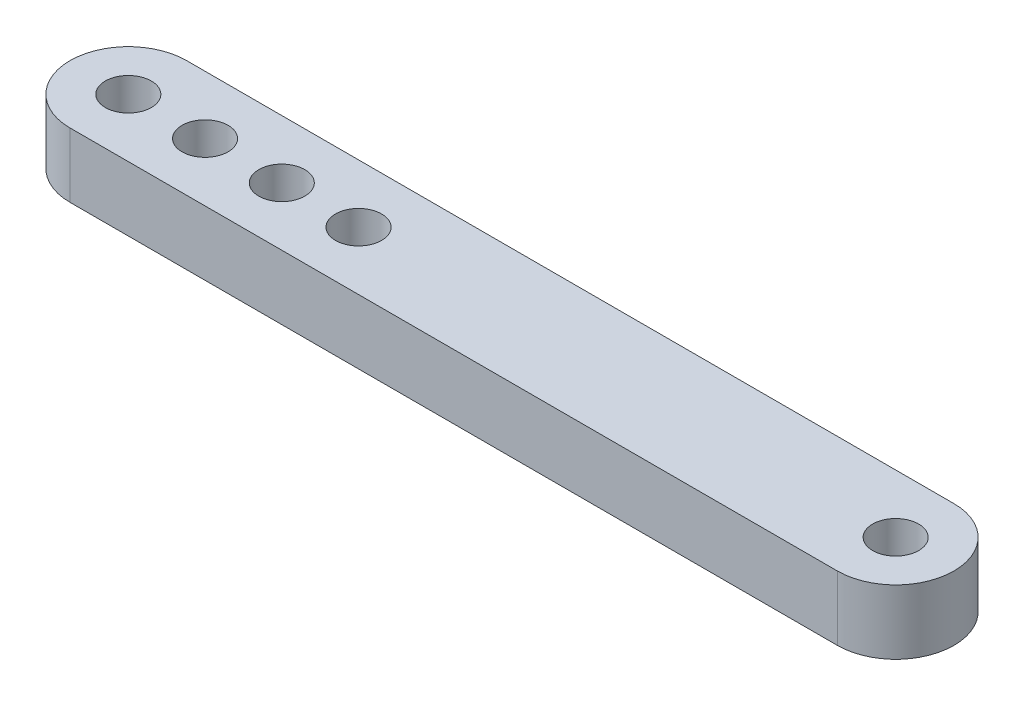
ISO-10303-21;
HEADER;
FILE_DESCRIPTION(('STEP AP214'),'2;1');
FILE_NAME('part.step','',(''),(''),'','','');
FILE_SCHEMA(('AUTOMOTIVE_DESIGN { 1 0 10303 214 1 1 1 1 }'));
ENDSEC;
DATA;
#1=APPLICATION_CONTEXT('core data for automotive mechanical design processes');
#2=APPLICATION_PROTOCOL_DEFINITION('international standard','automotive_design',2000,#1);
#3=PRODUCT_CONTEXT('',#1,'mechanical');
#4=PRODUCT('Part','Part','',(#3));
#5=PRODUCT_RELATED_PRODUCT_CATEGORY('part','',(#4));
#6=PRODUCT_DEFINITION_FORMATION('','',#4);
#7=PRODUCT_DEFINITION_CONTEXT('part definition',#1,'design');
#8=PRODUCT_DEFINITION('design','',#6,#7);
#9=PRODUCT_DEFINITION_SHAPE('','',#8);
#10=(LENGTH_UNIT() NAMED_UNIT(*) SI_UNIT(.MILLI.,.METRE.));
#11=(NAMED_UNIT(*) PLANE_ANGLE_UNIT() SI_UNIT($,.RADIAN.));
#12=(NAMED_UNIT(*) SI_UNIT($,.STERADIAN.) SOLID_ANGLE_UNIT());
#13=UNCERTAINTY_MEASURE_WITH_UNIT(LENGTH_MEASURE(1.E-05),#10,'distance_accuracy_value','');
#14=(GEOMETRIC_REPRESENTATION_CONTEXT(3) GLOBAL_UNCERTAINTY_ASSIGNED_CONTEXT((#13)) GLOBAL_UNIT_ASSIGNED_CONTEXT((#10,
#11,#12)) REPRESENTATION_CONTEXT('',''));
#15=CARTESIAN_POINT('',(0.,0.,0.));
#16=DIRECTION('',(0.,0.,1.));
#17=DIRECTION('',(1.,0.,0.));
#18=AXIS2_PLACEMENT_3D('',#15,#16,#17);
#19=CARTESIAN_POINT('',(25.,4.2,0.));
#20=DIRECTION('',(0.,-1.,0.));
#21=DIRECTION('',(0.,0.,-1.));
#22=AXIS2_PLACEMENT_3D('',#19,#20,#21);
#23=CYLINDRICAL_SURFACE('',#22,3.8);
#24=CARTESIAN_POINT('',(25.,0.,0.));
#25=DIRECTION('',(0.,1.,0.));
#26=DIRECTION('',(0.,0.,1.));
#27=AXIS2_PLACEMENT_3D('',#24,#25,#26);
#28=CIRCLE('',#27,3.8);
#29=CARTESIAN_POINT('',(25.,0.,3.79999999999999));
#30=VERTEX_POINT('',#29);
#31=CARTESIAN_POINT('',(25.,0.,-3.8));
#32=VERTEX_POINT('',#31);
#33=EDGE_CURVE('E134',#30,#32,#28,.T.);
#34=ORIENTED_EDGE('',*,*,#33,.T.);
#35=DIRECTION('',(0.,-1.,0.));
#36=VECTOR('',#35,1.);
#37=CARTESIAN_POINT('',(25.,4.2,-3.8));
#38=LINE('',#37,#36);
#39=CARTESIAN_POINT('',(25.,4.2,-3.8));
#40=VERTEX_POINT('',#39);
#41=EDGE_CURVE('E11',#40,#32,#38,.T.);
#42=ORIENTED_EDGE('',*,*,#41,.F.);
#43=CARTESIAN_POINT('',(25.,4.2,0.));
#44=DIRECTION('',(0.,1.,0.));
#45=DIRECTION('',(0.,0.,1.));
#46=AXIS2_PLACEMENT_3D('',#43,#44,#45);
#47=CIRCLE('',#46,3.8);
#48=CARTESIAN_POINT('',(25.,4.2,3.79999999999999));
#49=VERTEX_POINT('',#48);
#50=EDGE_CURVE('E96',#49,#40,#47,.T.);
#51=ORIENTED_EDGE('',*,*,#50,.F.);
#52=DIRECTION('',(0.,-1.,0.));
#53=VECTOR('',#52,1.);
#54=CARTESIAN_POINT('',(25.,4.2,3.79999999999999));
#55=LINE('',#54,#53);
#56=EDGE_CURVE('E62',#49,#30,#55,.T.);
#57=ORIENTED_EDGE('',*,*,#56,.T.);
#58=EDGE_LOOP('',(#34,#42,#51,#57));
#59=FACE_BOUND('',#58,.T.);
#60=ADVANCED_FACE('F45',(#59),#23,.T.);
#61=CARTESIAN_POINT('',(0.,4.2,-3.8));
#62=DIRECTION('',(0.,0.,1.));
#63=DIRECTION('',(1.,0.,0.));
#64=AXIS2_PLACEMENT_3D('',#61,#62,#63);
#65=PLANE('',#64);
#66=DIRECTION('',(-1.,0.,0.));
#67=VECTOR('',#66,1.);
#68=CARTESIAN_POINT('',(0.,0.,-3.8));
#69=LINE('',#68,#67);
#70=CARTESIAN_POINT('',(-25.,0.,-3.8));
#71=VERTEX_POINT('',#70);
#72=EDGE_CURVE('E102',#32,#71,#69,.T.);
#73=ORIENTED_EDGE('',*,*,#72,.T.);
#74=DIRECTION('',(0.,-1.,0.));
#75=VECTOR('',#74,1.);
#76=CARTESIAN_POINT('',(-25.,4.2,-3.8));
#77=LINE('',#76,#75);
#78=CARTESIAN_POINT('',(-25.,4.2,-3.8));
#79=VERTEX_POINT('',#78);
#80=EDGE_CURVE('E54',#79,#71,#77,.T.);
#81=ORIENTED_EDGE('',*,*,#80,.F.);
#82=DIRECTION('',(-1.,0.,0.));
#83=VECTOR('',#82,1.);
#84=CARTESIAN_POINT('',(0.,4.2,-3.8));
#85=LINE('',#84,#83);
#86=EDGE_CURVE('E88',#40,#79,#85,.T.);
#87=ORIENTED_EDGE('',*,*,#86,.F.);
#88=ORIENTED_EDGE('',*,*,#41,.T.);
#89=EDGE_LOOP('',(#73,#81,#87,#88));
#90=FACE_BOUND('',#89,.T.);
#91=ADVANCED_FACE('F101',(#90),#65,.F.);
#92=CARTESIAN_POINT('',(-25.,4.2,0.));
#93=DIRECTION('',(0.,-1.,0.));
#94=DIRECTION('',(0.,0.,-1.));
#95=AXIS2_PLACEMENT_3D('',#92,#93,#94);
#96=CYLINDRICAL_SURFACE('',#95,3.8);
#97=CARTESIAN_POINT('',(-25.,0.,0.));
#98=DIRECTION('',(0.,1.,0.));
#99=DIRECTION('',(0.,0.,1.));
#100=AXIS2_PLACEMENT_3D('',#97,#98,#99);
#101=CIRCLE('',#100,3.8);
#102=CARTESIAN_POINT('',(-25.,0.,3.8));
#103=VERTEX_POINT('',#102);
#104=EDGE_CURVE('E139',#71,#103,#101,.T.);
#105=ORIENTED_EDGE('',*,*,#104,.T.);
#106=DIRECTION('',(0.,-1.,0.));
#107=VECTOR('',#106,1.);
#108=CARTESIAN_POINT('',(-25.,4.2,3.8));
#109=LINE('',#108,#107);
#110=CARTESIAN_POINT('',(-25.,4.2,3.8));
#111=VERTEX_POINT('',#110);
#112=EDGE_CURVE('E77',#111,#103,#109,.T.);
#113=ORIENTED_EDGE('',*,*,#112,.F.);
#114=CARTESIAN_POINT('',(-25.,4.2,0.));
#115=DIRECTION('',(0.,1.,0.));
#116=DIRECTION('',(0.,0.,1.));
#117=AXIS2_PLACEMENT_3D('',#114,#115,#116);
#118=CIRCLE('',#117,3.8);
#119=EDGE_CURVE('E95',#79,#111,#118,.T.);
#120=ORIENTED_EDGE('',*,*,#119,.F.);
#121=ORIENTED_EDGE('',*,*,#80,.T.);
#122=EDGE_LOOP('',(#105,#113,#120,#121));
#123=FACE_BOUND('',#122,.T.);
#124=ADVANCED_FACE('F106',(#123),#96,.T.);
#125=CARTESIAN_POINT('',(-15.,4.2,0.));
#126=DIRECTION('',(0.,-1.,0.));
#127=DIRECTION('',(0.,0.,-1.));
#128=AXIS2_PLACEMENT_3D('',#125,#126,#127);
#129=CYLINDRICAL_SURFACE('',#128,1.5);
#130=CARTESIAN_POINT('',(-15.,4.2,0.));
#131=DIRECTION('',(0.,1.,0.));
#132=DIRECTION('',(0.,0.,1.));
#133=AXIS2_PLACEMENT_3D('',#130,#131,#132);
#134=CIRCLE('',#133,1.5);
#135=CARTESIAN_POINT('',(-15.,4.2,1.5));
#136=VERTEX_POINT('',#135);
#137=EDGE_CURVE('E126',#136,#136,#134,.T.);
#138=ORIENTED_EDGE('',*,*,#137,.T.);
#139=EDGE_LOOP('',(#138));
#140=FACE_BOUND('',#139,.T.);
#141=CARTESIAN_POINT('',(-15.,0.,0.));
#142=DIRECTION('',(0.,1.,0.));
#143=DIRECTION('',(0.,0.,1.));
#144=AXIS2_PLACEMENT_3D('',#141,#142,#143);
#145=CIRCLE('',#144,1.5);
#146=CARTESIAN_POINT('',(-15.,0.,1.5));
#147=VERTEX_POINT('',#146);
#148=EDGE_CURVE('E158',#147,#147,#145,.T.);
#149=ORIENTED_EDGE('',*,*,#148,.F.);
#150=EDGE_LOOP('',(#149));
#151=FACE_BOUND('',#150,.T.);
#152=ADVANCED_FACE('F203',(#140,#151),#129,.F.);
#153=CARTESIAN_POINT('',(-10.,4.2,0.));
#154=DIRECTION('',(0.,-1.,0.));
#155=DIRECTION('',(0.,0.,-1.));
#156=AXIS2_PLACEMENT_3D('',#153,#154,#155);
#157=CYLINDRICAL_SURFACE('',#156,1.5);
#158=CARTESIAN_POINT('',(-10.,4.2,0.));
#159=DIRECTION('',(0.,1.,0.));
#160=DIRECTION('',(0.,0.,1.));
#161=AXIS2_PLACEMENT_3D('',#158,#159,#160);
#162=CIRCLE('',#161,1.5);
#163=CARTESIAN_POINT('',(-10.,4.2,1.5));
#164=VERTEX_POINT('',#163);
#165=EDGE_CURVE('E122',#164,#164,#162,.T.);
#166=ORIENTED_EDGE('',*,*,#165,.T.);
#167=EDGE_LOOP('',(#166));
#168=FACE_BOUND('',#167,.T.);
#169=CARTESIAN_POINT('',(-10.,0.,0.));
#170=DIRECTION('',(0.,1.,0.));
#171=DIRECTION('',(0.,0.,1.));
#172=AXIS2_PLACEMENT_3D('',#169,#170,#171);
#173=CIRCLE('',#172,1.5);
#174=CARTESIAN_POINT('',(-10.,0.,1.5));
#175=VERTEX_POINT('',#174);
#176=EDGE_CURVE('E154',#175,#175,#173,.T.);
#177=ORIENTED_EDGE('',*,*,#176,.F.);
#178=EDGE_LOOP('',(#177));
#179=FACE_BOUND('',#178,.T.);
#180=ADVANCED_FACE('F205',(#168,#179),#157,.F.);
#181=CARTESIAN_POINT('',(-20.,4.2,0.));
#182=DIRECTION('',(0.,-1.,0.));
#183=DIRECTION('',(0.,0.,-1.));
#184=AXIS2_PLACEMENT_3D('',#181,#182,#183);
#185=CYLINDRICAL_SURFACE('',#184,1.5);
#186=CARTESIAN_POINT('',(-20.,4.2,0.));
#187=DIRECTION('',(0.,1.,0.));
#188=DIRECTION('',(0.,0.,1.));
#189=AXIS2_PLACEMENT_3D('',#186,#187,#188);
#190=CIRCLE('',#189,1.5);
#191=CARTESIAN_POINT('',(-20.,4.2,1.5));
#192=VERTEX_POINT('',#191);
#193=EDGE_CURVE('E118',#192,#192,#190,.T.);
#194=ORIENTED_EDGE('',*,*,#193,.T.);
#195=EDGE_LOOP('',(#194));
#196=FACE_BOUND('',#195,.T.);
#197=CARTESIAN_POINT('',(-20.,0.,0.));
#198=DIRECTION('',(0.,1.,0.));
#199=DIRECTION('',(0.,0.,1.));
#200=AXIS2_PLACEMENT_3D('',#197,#198,#199);
#201=CIRCLE('',#200,1.5);
#202=CARTESIAN_POINT('',(-20.,0.,1.5));
#203=VERTEX_POINT('',#202);
#204=EDGE_CURVE('E150',#203,#203,#201,.T.);
#205=ORIENTED_EDGE('',*,*,#204,.F.);
#206=EDGE_LOOP('',(#205));
#207=FACE_BOUND('',#206,.T.);
#208=ADVANCED_FACE('F211',(#196,#207),#185,.F.);
#209=CARTESIAN_POINT('',(25.,4.2,0.));
#210=DIRECTION('',(0.,-1.,0.));
#211=DIRECTION('',(0.,0.,-1.));
#212=AXIS2_PLACEMENT_3D('',#209,#210,#211);
#213=CYLINDRICAL_SURFACE('',#212,1.5);
#214=CARTESIAN_POINT('',(25.,4.2,0.));
#215=DIRECTION('',(0.,1.,0.));
#216=DIRECTION('',(0.,0.,1.));
#217=AXIS2_PLACEMENT_3D('',#214,#215,#216);
#218=CIRCLE('',#217,1.5);
#219=CARTESIAN_POINT('',(25.,4.2,1.5));
#220=VERTEX_POINT('',#219);
#221=EDGE_CURVE('E111',#220,#220,#218,.T.);
#222=ORIENTED_EDGE('',*,*,#221,.T.);
#223=EDGE_LOOP('',(#222));
#224=FACE_BOUND('',#223,.T.);
#225=CARTESIAN_POINT('',(25.,0.,0.));
#226=DIRECTION('',(0.,1.,0.));
#227=DIRECTION('',(0.,0.,1.));
#228=AXIS2_PLACEMENT_3D('',#225,#226,#227);
#229=CIRCLE('',#228,1.5);
#230=CARTESIAN_POINT('',(25.,0.,1.5));
#231=VERTEX_POINT('',#230);
#232=EDGE_CURVE('E146',#231,#231,#229,.T.);
#233=ORIENTED_EDGE('',*,*,#232,.F.);
#234=EDGE_LOOP('',(#233));
#235=FACE_BOUND('',#234,.T.);
#236=ADVANCED_FACE('F184',(#224,#235),#213,.F.);
#237=CARTESIAN_POINT('',(0.,4.2,3.8));
#238=DIRECTION('',(0.,0.,1.));
#239=DIRECTION('',(1.,0.,0.));
#240=AXIS2_PLACEMENT_3D('',#237,#238,#239);
#241=PLANE('',#240);
#242=DIRECTION('',(-1.,0.,0.));
#243=VECTOR('',#242,1.);
#244=CARTESIAN_POINT('',(0.,0.,3.8));
#245=LINE('',#244,#243);
#246=EDGE_CURVE('E142',#30,#103,#245,.T.);
#247=ORIENTED_EDGE('',*,*,#246,.F.);
#248=ORIENTED_EDGE('',*,*,#56,.F.);
#249=DIRECTION('',(-1.,0.,0.));
#250=VECTOR('',#249,1.);
#251=CARTESIAN_POINT('',(0.,4.2,3.8));
#252=LINE('',#251,#250);
#253=EDGE_CURVE('E108',#49,#111,#252,.T.);
#254=ORIENTED_EDGE('',*,*,#253,.T.);
#255=ORIENTED_EDGE('',*,*,#112,.T.);
#256=EDGE_LOOP('',(#247,#248,#254,#255));
#257=FACE_BOUND('',#256,.T.);
#258=ADVANCED_FACE('F176',(#257),#241,.T.);
#259=CARTESIAN_POINT('',(-25.,4.2,0.));
#260=DIRECTION('',(0.,-1.,0.));
#261=DIRECTION('',(0.,0.,-1.));
#262=AXIS2_PLACEMENT_3D('',#259,#260,#261);
#263=CYLINDRICAL_SURFACE('',#262,1.5);
#264=CARTESIAN_POINT('',(-25.,4.2,0.));
#265=DIRECTION('',(0.,1.,0.));
#266=DIRECTION('',(0.,0.,1.));
#267=AXIS2_PLACEMENT_3D('',#264,#265,#266);
#268=CIRCLE('',#267,1.5);
#269=CARTESIAN_POINT('',(-25.,4.2,1.5));
#270=VERTEX_POINT('',#269);
#271=EDGE_CURVE('E130',#270,#270,#268,.T.);
#272=ORIENTED_EDGE('',*,*,#271,.T.);
#273=EDGE_LOOP('',(#272));
#274=FACE_BOUND('',#273,.T.);
#275=CARTESIAN_POINT('',(-25.,0.,0.));
#276=DIRECTION('',(0.,1.,0.));
#277=DIRECTION('',(0.,0.,1.));
#278=AXIS2_PLACEMENT_3D('',#275,#276,#277);
#279=CIRCLE('',#278,1.5);
#280=CARTESIAN_POINT('',(-25.,0.,1.5));
#281=VERTEX_POINT('',#280);
#282=EDGE_CURVE('E162',#281,#281,#279,.T.);
#283=ORIENTED_EDGE('',*,*,#282,.F.);
#284=EDGE_LOOP('',(#283));
#285=FACE_BOUND('',#284,.T.);
#286=ADVANCED_FACE('F174',(#274,#285),#263,.F.);
#287=CARTESIAN_POINT('',(0.,4.2,0.));
#288=DIRECTION('',(0.,1.,0.));
#289=DIRECTION('',(0.,0.,1.));
#290=AXIS2_PLACEMENT_3D('',#287,#288,#289);
#291=PLANE('',#290);
#292=ORIENTED_EDGE('',*,*,#50,.T.);
#293=ORIENTED_EDGE('',*,*,#86,.T.);
#294=ORIENTED_EDGE('',*,*,#119,.T.);
#295=ORIENTED_EDGE('',*,*,#253,.F.);
#296=EDGE_LOOP('',(#292,#293,#294,#295));
#297=FACE_BOUND('',#296,.T.);
#298=ORIENTED_EDGE('',*,*,#221,.F.);
#299=EDGE_LOOP('',(#298));
#300=FACE_BOUND('',#299,.T.);
#301=ORIENTED_EDGE('',*,*,#193,.F.);
#302=EDGE_LOOP('',(#301));
#303=FACE_BOUND('',#302,.T.);
#304=ORIENTED_EDGE('',*,*,#165,.F.);
#305=EDGE_LOOP('',(#304));
#306=FACE_BOUND('',#305,.T.);
#307=ORIENTED_EDGE('',*,*,#137,.F.);
#308=EDGE_LOOP('',(#307));
#309=FACE_BOUND('',#308,.T.);
#310=ORIENTED_EDGE('',*,*,#271,.F.);
#311=EDGE_LOOP('',(#310));
#312=FACE_BOUND('',#311,.T.);
#313=ADVANCED_FACE('F91',(#297,#300,#303,#306,#309,#312),#291,.T.);
#314=CARTESIAN_POINT('',(0.,0.,0.));
#315=DIRECTION('',(0.,1.,0.));
#316=DIRECTION('',(0.,0.,1.));
#317=AXIS2_PLACEMENT_3D('',#314,#315,#316);
#318=PLANE('',#317);
#319=ORIENTED_EDGE('',*,*,#33,.F.);
#320=ORIENTED_EDGE('',*,*,#246,.T.);
#321=ORIENTED_EDGE('',*,*,#104,.F.);
#322=ORIENTED_EDGE('',*,*,#72,.F.);
#323=EDGE_LOOP('',(#319,#320,#321,#322));
#324=FACE_BOUND('',#323,.T.);
#325=ORIENTED_EDGE('',*,*,#232,.T.);
#326=EDGE_LOOP('',(#325));
#327=FACE_BOUND('',#326,.T.);
#328=ORIENTED_EDGE('',*,*,#204,.T.);
#329=EDGE_LOOP('',(#328));
#330=FACE_BOUND('',#329,.T.);
#331=ORIENTED_EDGE('',*,*,#176,.T.);
#332=EDGE_LOOP('',(#331));
#333=FACE_BOUND('',#332,.T.);
#334=ORIENTED_EDGE('',*,*,#148,.T.);
#335=EDGE_LOOP('',(#334));
#336=FACE_BOUND('',#335,.T.);
#337=ORIENTED_EDGE('',*,*,#282,.T.);
#338=EDGE_LOOP('',(#337));
#339=FACE_BOUND('',#338,.T.);
#340=ADVANCED_FACE('F172',(#324,#327,#330,#333,#336,#339),#318,.F.);
#341=CLOSED_SHELL('',(#60,#91,#124,#152,#180,#208,#236,#258,#286,#313,#340));
#342=MANIFOLD_SOLID_BREP('B2',#341);
#343=ADVANCED_BREP_SHAPE_REPRESENTATION('',(#18,#342),#14);
#344=SHAPE_DEFINITION_REPRESENTATION(#9,#343);
ENDSEC;
END-ISO-10303-21;
